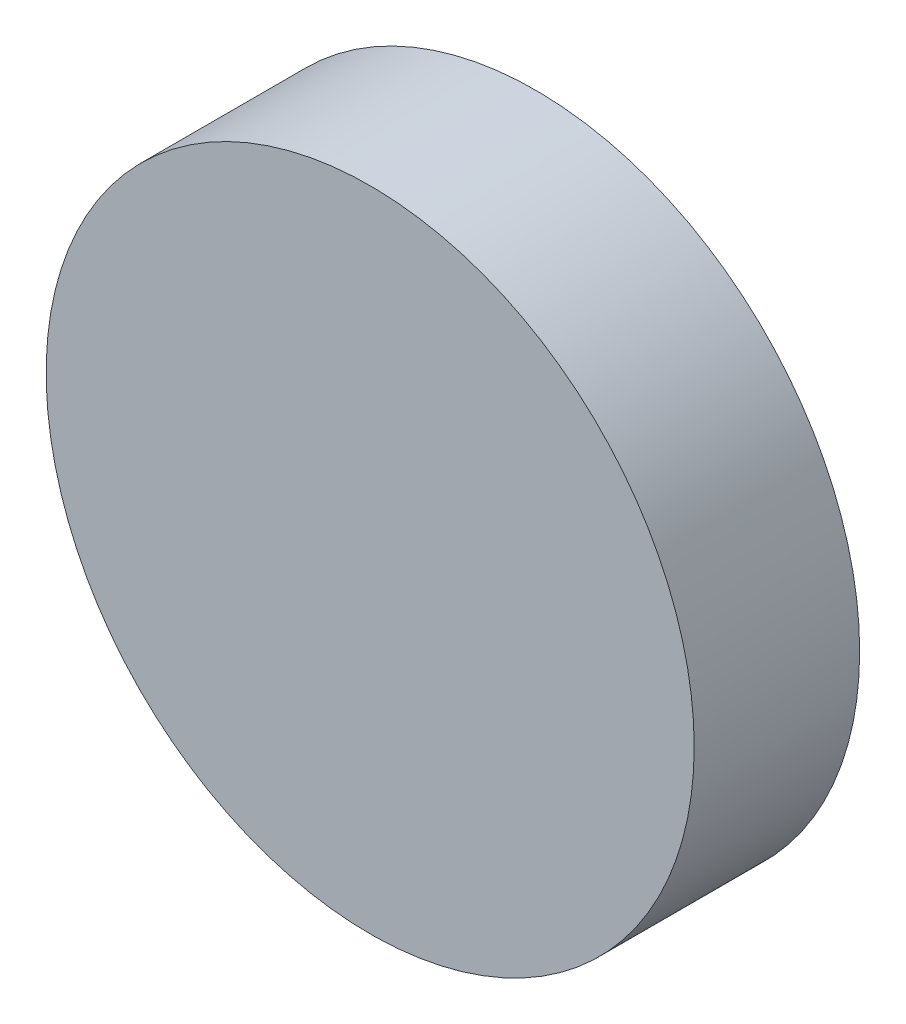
ISO-10303-21;
HEADER;
FILE_DESCRIPTION(('STEP AP214'),'2;1');
FILE_NAME('part.step','',(''),(''),'','','');
FILE_SCHEMA(('AUTOMOTIVE_DESIGN { 1 0 10303 214 1 1 1 1 }'));
ENDSEC;
DATA;
#1=APPLICATION_CONTEXT('core data for automotive mechanical design processes');
#2=APPLICATION_PROTOCOL_DEFINITION('international standard','automotive_design',2000,#1);
#3=PRODUCT_CONTEXT('',#1,'mechanical');
#4=PRODUCT('Part','Part','',(#3));
#5=PRODUCT_RELATED_PRODUCT_CATEGORY('part','',(#4));
#6=PRODUCT_DEFINITION_FORMATION('','',#4);
#7=PRODUCT_DEFINITION_CONTEXT('part definition',#1,'design');
#8=PRODUCT_DEFINITION('design','',#6,#7);
#9=PRODUCT_DEFINITION_SHAPE('','',#8);
#10=(LENGTH_UNIT() NAMED_UNIT(*) SI_UNIT(.MILLI.,.METRE.));
#11=(NAMED_UNIT(*) PLANE_ANGLE_UNIT() SI_UNIT($,.RADIAN.));
#12=(NAMED_UNIT(*) SI_UNIT($,.STERADIAN.) SOLID_ANGLE_UNIT());
#13=UNCERTAINTY_MEASURE_WITH_UNIT(LENGTH_MEASURE(1.E-05),#10,'distance_accuracy_value','');
#14=(GEOMETRIC_REPRESENTATION_CONTEXT(3) GLOBAL_UNCERTAINTY_ASSIGNED_CONTEXT((#13)) GLOBAL_UNIT_ASSIGNED_CONTEXT((#10,
#11,#12)) REPRESENTATION_CONTEXT('',''));
#15=CARTESIAN_POINT('',(0.,0.,0.));
#16=DIRECTION('',(0.,0.,1.));
#17=DIRECTION('',(1.,0.,0.));
#18=AXIS2_PLACEMENT_3D('',#15,#16,#17);
#19=CARTESIAN_POINT('',(0.,0.,-7.));
#20=DIRECTION('',(0.,0.,1.));
#21=DIRECTION('',(1.,0.,0.));
#22=AXIS2_PLACEMENT_3D('',#19,#20,#21);
#23=CYLINDRICAL_SURFACE('',#22,23.5);
#24=CARTESIAN_POINT('',(0.,0.,-7.));
#25=DIRECTION('',(0.,0.,1.));
#26=DIRECTION('',(1.,0.,0.));
#27=AXIS2_PLACEMENT_3D('',#24,#25,#26);
#28=CIRCLE('',#27,23.5);
#29=CARTESIAN_POINT('',(23.5,0.,-7.));
#30=VERTEX_POINT('',#29);
#31=EDGE_CURVE('E45',#30,#30,#28,.T.);
#32=ORIENTED_EDGE('',*,*,#31,.T.);
#33=EDGE_LOOP('',(#32));
#34=FACE_BOUND('',#33,.T.);
#35=CARTESIAN_POINT('',(0.,0.,5.));
#36=DIRECTION('',(0.,0.,1.));
#37=DIRECTION('',(1.,0.,0.));
#38=AXIS2_PLACEMENT_3D('',#35,#36,#37);
#39=CIRCLE('',#38,23.5);
#40=CARTESIAN_POINT('',(23.5,0.,5.));
#41=VERTEX_POINT('',#40);
#42=EDGE_CURVE('E49',#41,#41,#39,.T.);
#43=ORIENTED_EDGE('',*,*,#42,.F.);
#44=EDGE_LOOP('',(#43));
#45=FACE_BOUND('',#44,.T.);
#46=ADVANCED_FACE('F39',(#34,#45),#23,.T.);
#47=CARTESIAN_POINT('',(0.,0.,-7.));
#48=DIRECTION('',(0.,0.,1.));
#49=DIRECTION('',(1.,0.,0.));
#50=AXIS2_PLACEMENT_3D('',#47,#48,#49);
#51=PLANE('',#50);
#52=CARTESIAN_POINT('',(0.,0.,-7.));
#53=DIRECTION('',(0.,0.,1.));
#54=DIRECTION('',(1.,0.,0.));
#55=AXIS2_PLACEMENT_3D('',#52,#53,#54);
#56=CIRCLE('',#55,18.5);
#57=CARTESIAN_POINT('',(18.5,0.,-7.));
#58=VERTEX_POINT('',#57);
#59=EDGE_CURVE('E10',#58,#58,#56,.F.);
#60=ORIENTED_EDGE('',*,*,#59,.F.);
#61=EDGE_LOOP('',(#60));
#62=FACE_BOUND('',#61,.T.);
#63=ORIENTED_EDGE('',*,*,#31,.F.);
#64=EDGE_LOOP('',(#63));
#65=FACE_BOUND('',#64,.T.);
#66=ADVANCED_FACE('F83',(#62,#65),#51,.F.);
#67=CARTESIAN_POINT('',(0.,0.,5.));
#68=DIRECTION('',(0.,0.,1.));
#69=DIRECTION('',(1.,0.,0.));
#70=AXIS2_PLACEMENT_3D('',#67,#68,#69);
#71=PLANE('',#70);
#72=ORIENTED_EDGE('',*,*,#42,.T.);
#73=EDGE_LOOP('',(#72));
#74=FACE_BOUND('',#73,.T.);
#75=ADVANCED_FACE('F102',(#74),#71,.T.);
#76=CARTESIAN_POINT('',(0.,0.,-8.5));
#77=DIRECTION('',(0.,0.,-1.));
#78=DIRECTION('',(-1.,0.,0.));
#79=AXIS2_PLACEMENT_3D('',#76,#77,#78);
#80=PLANE('',#79);
#81=CARTESIAN_POINT('',(0.,0.,-8.5));
#82=DIRECTION('',(0.,0.,-1.));
#83=DIRECTION('',(-1.,0.,0.));
#84=AXIS2_PLACEMENT_3D('',#81,#82,#83);
#85=CIRCLE('',#84,18.5);
#86=CARTESIAN_POINT('',(-18.5,0.,-8.5));
#87=VERTEX_POINT('',#86);
#88=EDGE_CURVE('E53',#87,#87,#85,.T.);
#89=ORIENTED_EDGE('',*,*,#88,.T.);
#90=EDGE_LOOP('',(#89));
#91=FACE_BOUND('',#90,.T.);
#92=CARTESIAN_POINT('',(0.,0.,-8.5));
#93=DIRECTION('',(0.,0.,-1.));
#94=DIRECTION('',(-1.,0.,0.));
#95=AXIS2_PLACEMENT_3D('',#92,#93,#94);
#96=CIRCLE('',#95,13.25);
#97=CARTESIAN_POINT('',(-13.25,0.,-8.5));
#98=VERTEX_POINT('',#97);
#99=EDGE_CURVE('E58',#98,#98,#96,.T.);
#100=ORIENTED_EDGE('',*,*,#99,.F.);
#101=EDGE_LOOP('',(#100));
#102=FACE_BOUND('',#101,.T.);
#103=ADVANCED_FACE('F93',(#91,#102),#80,.T.);
#104=CARTESIAN_POINT('',(0.,0.,-8.5));
#105=DIRECTION('',(0.,0.,1.));
#106=DIRECTION('',(1.,0.,0.));
#107=AXIS2_PLACEMENT_3D('',#104,#105,#106);
#108=CYLINDRICAL_SURFACE('',#107,18.5);
#109=ORIENTED_EDGE('',*,*,#88,.F.);
#110=EDGE_LOOP('',(#109));
#111=FACE_BOUND('',#110,.T.);
#112=ORIENTED_EDGE('',*,*,#59,.T.);
#113=EDGE_LOOP('',(#112));
#114=FACE_BOUND('',#113,.T.);
#115=ADVANCED_FACE('F87',(#111,#114),#108,.T.);
#116=CARTESIAN_POINT('',(0.,0.,-8.5));
#117=DIRECTION('',(0.,0.,1.));
#118=DIRECTION('',(1.,0.,0.));
#119=AXIS2_PLACEMENT_3D('',#116,#117,#118);
#120=CYLINDRICAL_SURFACE('',#119,13.25);
#121=ORIENTED_EDGE('',*,*,#99,.T.);
#122=EDGE_LOOP('',(#121));
#123=FACE_BOUND('',#122,.T.);
#124=CARTESIAN_POINT('',(0.,0.,-7.));
#125=DIRECTION('',(0.,0.,-1.));
#126=DIRECTION('',(-1.,0.,0.));
#127=AXIS2_PLACEMENT_3D('',#124,#125,#126);
#128=CIRCLE('',#127,13.25);
#129=CARTESIAN_POINT('',(-13.25,0.,-7.));
#130=VERTEX_POINT('',#129);
#131=EDGE_CURVE('E59',#130,#130,#128,.T.);
#132=ORIENTED_EDGE('',*,*,#131,.F.);
#133=EDGE_LOOP('',(#132));
#134=FACE_BOUND('',#133,.T.);
#135=ADVANCED_FACE('F82',(#123,#134),#120,.F.);
#136=CARTESIAN_POINT('',(0.,0.,-7.));
#137=DIRECTION('',(0.,0.,-1.));
#138=DIRECTION('',(-1.,0.,0.));
#139=AXIS2_PLACEMENT_3D('',#136,#137,#138);
#140=CIRCLE('',#139,7.95);
#141=CARTESIAN_POINT('',(-7.95,0.,-7.));
#142=VERTEX_POINT('',#141);
#143=EDGE_CURVE('E65',#142,#142,#140,.T.);
#144=ORIENTED_EDGE('',*,*,#143,.F.);
#145=EDGE_LOOP('',(#144));
#146=FACE_BOUND('',#145,.T.);
#147=ORIENTED_EDGE('',*,*,#131,.T.);
#148=EDGE_LOOP('',(#147));
#149=FACE_BOUND('',#148,.T.);
#150=ADVANCED_FACE('F76',(#146,#149),#51,.F.);
#151=CARTESIAN_POINT('',(0.,0.,0.));
#152=DIRECTION('',(0.,0.,-1.));
#153=DIRECTION('',(-1.,0.,0.));
#154=AXIS2_PLACEMENT_3D('',#151,#152,#153);
#155=CYLINDRICAL_SURFACE('',#154,7.95);
#156=CARTESIAN_POINT('',(0.,0.,0.));
#157=DIRECTION('',(0.,0.,-1.));
#158=DIRECTION('',(-1.,0.,0.));
#159=AXIS2_PLACEMENT_3D('',#156,#157,#158);
#160=CIRCLE('',#159,7.95);
#161=CARTESIAN_POINT('',(-7.95,0.,0.));
#162=VERTEX_POINT('',#161);
#163=EDGE_CURVE('E62',#162,#162,#160,.T.);
#164=ORIENTED_EDGE('',*,*,#163,.F.);
#165=EDGE_LOOP('',(#164));
#166=FACE_BOUND('',#165,.T.);
#167=ORIENTED_EDGE('',*,*,#143,.T.);
#168=EDGE_LOOP('',(#167));
#169=FACE_BOUND('',#168,.T.);
#170=ADVANCED_FACE('F73',(#166,#169),#155,.F.);
#171=CARTESIAN_POINT('',(0.,0.,0.));
#172=DIRECTION('',(0.,0.,-1.));
#173=DIRECTION('',(-1.,0.,0.));
#174=AXIS2_PLACEMENT_3D('',#171,#172,#173);
#175=PLANE('',#174);
#176=ORIENTED_EDGE('',*,*,#163,.T.);
#177=EDGE_LOOP('',(#176));
#178=FACE_BOUND('',#177,.T.);
#179=ADVANCED_FACE('F71',(#178),#175,.T.);
#180=CLOSED_SHELL('',(#46,#66,#75,#103,#115,#135,#150,#170,#179));
#181=MANIFOLD_SOLID_BREP('B2',#180);
#182=ADVANCED_BREP_SHAPE_REPRESENTATION('',(#18,#181),#14);
#183=SHAPE_DEFINITION_REPRESENTATION(#9,#182);
ENDSEC;
END-ISO-10303-21;
